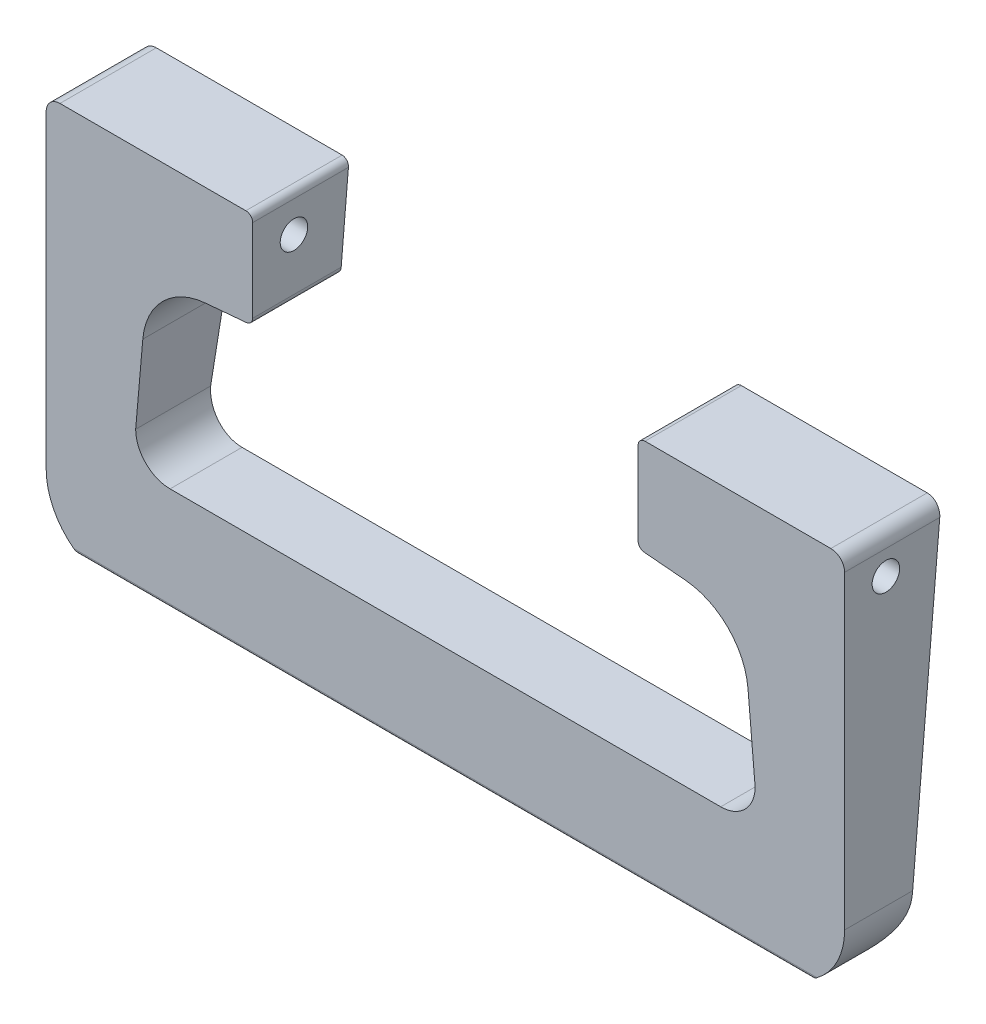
ISO-10303-21;
HEADER;
FILE_DESCRIPTION(('STEP AP214'),'2;1');
FILE_NAME('part.step','',(''),(''),'','','');
FILE_SCHEMA(('AUTOMOTIVE_DESIGN { 1 0 10303 214 1 1 1 1 }'));
ENDSEC;
DATA;
#1=APPLICATION_CONTEXT('core data for automotive mechanical design processes');
#2=APPLICATION_PROTOCOL_DEFINITION('international standard','automotive_design',2000,#1);
#3=PRODUCT_CONTEXT('',#1,'mechanical');
#4=PRODUCT('Part','Part','',(#3));
#5=PRODUCT_RELATED_PRODUCT_CATEGORY('part','',(#4));
#6=PRODUCT_DEFINITION_FORMATION('','',#4);
#7=PRODUCT_DEFINITION_CONTEXT('part definition',#1,'design');
#8=PRODUCT_DEFINITION('design','',#6,#7);
#9=PRODUCT_DEFINITION_SHAPE('','',#8);
#10=(LENGTH_UNIT() NAMED_UNIT(*) SI_UNIT(.MILLI.,.METRE.));
#11=(NAMED_UNIT(*) PLANE_ANGLE_UNIT() SI_UNIT($,.RADIAN.));
#12=(NAMED_UNIT(*) SI_UNIT($,.STERADIAN.) SOLID_ANGLE_UNIT());
#13=UNCERTAINTY_MEASURE_WITH_UNIT(LENGTH_MEASURE(1.E-05),#10,'distance_accuracy_value','');
#14=(GEOMETRIC_REPRESENTATION_CONTEXT(3) GLOBAL_UNCERTAINTY_ASSIGNED_CONTEXT((#13)) GLOBAL_UNIT_ASSIGNED_CONTEXT((#10,
#11,#12)) REPRESENTATION_CONTEXT('',''));
#15=CARTESIAN_POINT('',(0.,0.,0.));
#16=DIRECTION('',(0.,0.,1.));
#17=DIRECTION('',(1.,0.,0.));
#18=AXIS2_PLACEMENT_3D('',#15,#16,#17);
#19=CARTESIAN_POINT('',(-58.,3.5,6.));
#20=DIRECTION('',(1.,0.,0.));
#21=DIRECTION('',(0.,0.,-1.));
#22=AXIS2_PLACEMENT_3D('',#19,#20,#21);
#23=PLANE('',#22);
#24=CARTESIAN_POINT('',(-58.,0.,0.));
#25=DIRECTION('',(-1.,0.,0.));
#26=DIRECTION('',(0.,0.,1.));
#27=AXIS2_PLACEMENT_3D('',#24,#25,#26);
#28=CIRCLE('',#27,2.);
#29=CARTESIAN_POINT('',(-58.,0.,2.));
#30=VERTEX_POINT('',#29);
#31=EDGE_CURVE('E288',#30,#30,#28,.T.);
#32=ORIENTED_EDGE('',*,*,#31,.F.);
#33=EDGE_LOOP('',(#32));
#34=FACE_BOUND('',#33,.T.);
#35=DIRECTION('',(0.,0.996194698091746,-0.0871557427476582));
#36=VECTOR('',#35,1.);
#37=CARTESIAN_POINT('',(-58.,2.2996550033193,-7.72000609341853));
#38=LINE('',#37,#36);
#39=CARTESIAN_POINT('',(-58.,-41.5,-3.88803281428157));
#40=VERTEX_POINT('',#39);
#41=CARTESIAN_POINT('',(-58.,3.5,-7.82502267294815));
#42=VERTEX_POINT('',#41);
#43=EDGE_CURVE('E292',#40,#42,#38,.T.);
#44=ORIENTED_EDGE('',*,*,#43,.F.);
#45=DIRECTION('',(0.,0.,-1.));
#46=VECTOR('',#45,1.);
#47=CARTESIAN_POINT('',(-58.,-41.5,6.));
#48=LINE('',#47,#46);
#49=CARTESIAN_POINT('',(-58.,-41.5,6.));
#50=VERTEX_POINT('',#49);
#51=EDGE_CURVE('E214',#50,#40,#48,.T.);
#52=ORIENTED_EDGE('',*,*,#51,.F.);
#53=DIRECTION('',(0.,-1.,0.));
#54=VECTOR('',#53,1.);
#55=CARTESIAN_POINT('',(-58.,3.5,6.));
#56=LINE('',#55,#54);
#57=CARTESIAN_POINT('',(-58.,3.5,6.));
#58=VERTEX_POINT('',#57);
#59=EDGE_CURVE('E244',#58,#50,#56,.T.);
#60=ORIENTED_EDGE('',*,*,#59,.F.);
#61=DIRECTION('',(0.,0.,-1.));
#62=VECTOR('',#61,1.);
#63=CARTESIAN_POINT('',(-58.,3.5,6.));
#64=LINE('',#63,#62);
#65=EDGE_CURVE('E295',#58,#42,#64,.T.);
#66=ORIENTED_EDGE('',*,*,#65,.T.);
#67=EDGE_LOOP('',(#44,#52,#60,#66));
#68=FACE_BOUND('',#67,.T.);
#69=ADVANCED_FACE('F14',(#34,#68),#23,.F.);
#70=CARTESIAN_POINT('',(-48.,-41.5,6.));
#71=DIRECTION('',(0.,0.,-1.));
#72=DIRECTION('',(-1.,0.,0.));
#73=AXIS2_PLACEMENT_3D('',#70,#71,#72);
#74=CYLINDRICAL_SURFACE('',#73,10.);
#75=CARTESIAN_POINT('',(-48.,-41.5,-3.88803281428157));
#76=DIRECTION('',(0.,-0.0871557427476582,-0.996194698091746));
#77=DIRECTION('',(0.,0.996194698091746,-0.0871557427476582));
#78=AXIS2_PLACEMENT_3D('',#75,#76,#77);
#79=ELLIPSE('',#78,10.0381983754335,10.);
#80=CARTESIAN_POINT('',(-57.9280714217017,-42.6972459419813,-3.7832873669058));
#81=VERTEX_POINT('',#80);
#82=EDGE_CURVE('E297',#81,#40,#79,.T.);
#83=ORIENTED_EDGE('',*,*,#82,.F.);
#84=CARTESIAN_POINT('',(-57.9280714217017,-42.6972459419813,-3.7832873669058));
#85=CARTESIAN_POINT('',(-57.9157537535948,-42.7994032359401,-3.7743510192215));
#86=CARTESIAN_POINT('',(-57.9018780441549,-42.9011836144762,-3.76346541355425));
#87=CARTESIAN_POINT('',(-57.8710868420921,-43.1037888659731,-3.73787475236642));
#88=CARTESIAN_POINT('',(-57.8541716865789,-43.2046138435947,-3.72317012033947));
#89=CARTESIAN_POINT('',(-57.7990262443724,-43.5051179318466,-3.67348712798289));
#90=CARTESIAN_POINT('',(-57.7563625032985,-43.7031014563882,-3.63291525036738));
#91=CARTESIAN_POINT('',(-57.6605248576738,-44.0911125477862,-3.53815852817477));
#92=CARTESIAN_POINT('',(-57.6074492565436,-44.2811957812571,-3.48409981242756));
#93=CARTESIAN_POINT('',(-57.4915317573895,-44.6542000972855,-3.36314514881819));
#94=CARTESIAN_POINT('',(-57.4286874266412,-44.8371193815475,-3.29624600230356));
#95=CARTESIAN_POINT('',(-57.2946218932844,-45.1940746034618,-3.15095377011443));
#96=CARTESIAN_POINT('',(-57.2234391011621,-45.3681463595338,-3.07261300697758));
#97=CARTESIAN_POINT('',(-57.0736065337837,-45.7076273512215,-2.90522726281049));
#98=CARTESIAN_POINT('',(-56.9949572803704,-45.8730371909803,-2.81618302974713));
#99=CARTESIAN_POINT('',(-56.7489469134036,-46.3566197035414,-2.53380329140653));
#100=CARTESIAN_POINT('',(-56.5718301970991,-46.6613491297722,-2.32555116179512));
#101=CARTESIAN_POINT('',(-56.2554110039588,-47.1485483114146,-1.94221277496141));
#102=CARTESIAN_POINT('',(-56.1203513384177,-47.3405790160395,-1.77544478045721));
#103=CARTESIAN_POINT('',(-55.8445680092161,-47.7060533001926,-1.42663851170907));
#104=CARTESIAN_POINT('',(-55.7038419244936,-47.8794888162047,-1.24459367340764));
#105=CARTESIAN_POINT('',(-55.4197519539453,-48.2077915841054,-0.866074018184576));
#106=CARTESIAN_POINT('',(-55.2763858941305,-48.3626426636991,-0.669586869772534));
#107=CARTESIAN_POINT('',(-54.9905769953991,-48.6535540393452,-0.262636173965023));
#108=CARTESIAN_POINT('',(-54.8481338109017,-48.7896218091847,-0.0521782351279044));
#109=CARTESIAN_POINT('',(-54.6111434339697,-49.0039967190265,0.316572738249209));
#110=CARTESIAN_POINT('',(-54.5152619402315,-49.0872481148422,0.471152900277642));
#111=CARTESIAN_POINT('',(-54.3277600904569,-49.2443136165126,0.787574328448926));
#112=CARTESIAN_POINT('',(-54.2361399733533,-49.3181271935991,0.949416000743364));
#113=CARTESIAN_POINT('',(-54.0595822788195,-49.4557504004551,1.2804425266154));
#114=CARTESIAN_POINT('',(-53.9746325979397,-49.519578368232,1.44961317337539));
#115=CARTESIAN_POINT('',(-53.8141416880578,-49.6366836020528,1.7957718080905));
#116=CARTESIAN_POINT('',(-53.7385959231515,-49.6899659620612,1.97275597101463));
#117=CARTESIAN_POINT('',(-53.574908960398,-49.802625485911,2.40175247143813));
#118=CARTESIAN_POINT('',(-53.4923755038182,-49.8570204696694,2.65739166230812));
#119=CARTESIAN_POINT('',(-53.39494645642,-49.9199791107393,3.0498412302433));
#120=CARTESIAN_POINT('',(-53.3668846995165,-49.9378485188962,3.18197885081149));
#121=CARTESIAN_POINT('',(-53.3206969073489,-49.9670501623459,3.44866664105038));
#122=CARTESIAN_POINT('',(-53.3025641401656,-49.9783868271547,3.58321511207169));
#123=CARTESIAN_POINT('',(-53.2825570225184,-49.990857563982,3.79607440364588));
#124=CARTESIAN_POINT('',(-53.2770473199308,-49.9942805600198,3.87393028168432));
#125=CARTESIAN_POINT('',(-53.269676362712,-49.9988539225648,4.02994242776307));
#126=CARTESIAN_POINT('',(-53.2678180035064,-50.000002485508,4.10809888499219));
#127=CARTESIAN_POINT('',(-53.2678268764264,-50.,4.18627021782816));
#128=B_SPLINE_CURVE_WITH_KNOTS('',3,(#84,#85,#86,#87,#88,#89,#90,#91,#92,#93,#94,#95,#96,#97,
#98,#99,#100,#101,#102,#103,#104,#105,#106,#107,#108,#109,#110,#111,#112,#113,#114,#115,#116,
#117,#118,#119,#120,#121,#122,#123,#124,#125,#126,#127),.UNSPECIFIED.,.F.,.F.,(4,2,2,2,2,2,2,2,
2,2,2,2,2,2,2,2,2,2,2,2,2,4),(0.,0.309788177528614,0.619542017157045,1.23821807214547,
1.85131199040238,2.46455883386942,3.07508435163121,3.68556723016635,4.90925171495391,
5.77223517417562,6.63559135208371,7.49969346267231,8.36345075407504,8.96324930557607,
9.56308144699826,10.1617987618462,10.7602261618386,11.5790438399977,11.9873936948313,
12.3954663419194,12.6297359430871,12.8641912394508),.UNSPECIFIED.);
#129=CARTESIAN_POINT('',(-53.2678268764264,-50.,4.18627021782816));
#130=VERTEX_POINT('',#129);
#131=EDGE_CURVE('E200',#81,#130,#128,.T.);
#132=ORIENTED_EDGE('',*,*,#131,.T.);
#133=DIRECTION('',(0.,0.,-1.));
#134=VECTOR('',#133,1.);
#135=CARTESIAN_POINT('',(-53.2678268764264,-50.,6.));
#136=LINE('',#135,#134);
#137=CARTESIAN_POINT('',(-53.2678268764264,-50.,5.5));
#138=VERTEX_POINT('',#137);
#139=EDGE_CURVE('E242',#138,#130,#136,.T.);
#140=ORIENTED_EDGE('',*,*,#139,.F.);
#141=CARTESIAN_POINT('',(-53.2678268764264,-50.,5.5));
#142=CARTESIAN_POINT('',(-53.2677926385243,-50.0000200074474,5.51595689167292));
#143=CARTESIAN_POINT('',(-53.2690577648,-49.9992372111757,5.53186312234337));
#144=CARTESIAN_POINT('',(-53.273872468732,-49.9962510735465,5.5630221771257));
#145=CARTESIAN_POINT('',(-53.2773976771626,-49.9940628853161,5.57828014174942));
#146=CARTESIAN_POINT('',(-53.2874978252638,-49.9877798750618,5.61145249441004));
#147=CARTESIAN_POINT('',(-53.2945967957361,-49.9833565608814,5.62914190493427));
#148=CARTESIAN_POINT('',(-53.311117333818,-49.9730235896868,5.66298309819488));
#149=CARTESIAN_POINT('',(-53.3205490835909,-49.9671074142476,5.67912769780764));
#150=CARTESIAN_POINT('',(-53.3466160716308,-49.9506828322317,5.71803998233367));
#151=CARTESIAN_POINT('',(-53.3643996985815,-49.939414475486,5.73970844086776));
#152=CARTESIAN_POINT('',(-53.4023883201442,-49.9151479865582,5.77964018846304));
#153=CARTESIAN_POINT('',(-53.4225981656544,-49.9021463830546,5.79789646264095));
#154=CARTESIAN_POINT('',(-53.4801684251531,-49.8647857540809,5.84403841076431));
#155=CARTESIAN_POINT('',(-53.5190846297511,-49.8391843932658,5.86895931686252));
#156=CARTESIAN_POINT('',(-53.5991618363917,-49.7856342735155,5.91181056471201));
#157=CARTESIAN_POINT('',(-53.6403309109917,-49.7576768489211,5.92971359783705));
#158=CARTESIAN_POINT('',(-53.7083053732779,-49.7107414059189,5.95387544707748));
#159=CARTESIAN_POINT('',(-53.734808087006,-49.6922546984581,5.96199355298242));
#160=CARTESIAN_POINT('',(-53.7880493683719,-49.6547253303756,5.97587896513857));
#161=CARTESIAN_POINT('',(-53.8147880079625,-49.6356824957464,5.9816455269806));
#162=CARTESIAN_POINT('',(-53.8679956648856,-49.5973876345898,5.99081442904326));
#163=CARTESIAN_POINT('',(-53.8944638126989,-49.5781413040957,5.99424576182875));
#164=CARTESIAN_POINT('',(-53.9473200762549,-49.5393074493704,5.99883318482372));
#165=CARTESIAN_POINT('',(-53.9737082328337,-49.5197201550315,5.99999075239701));
#166=CARTESIAN_POINT('',(-54.,-49.5,6.));
#167=B_SPLINE_CURVE_WITH_KNOTS('',3,(#141,#142,#143,#144,#145,#146,#147,#148,#149,#150,#151,
#152,#153,#154,#155,#156,#157,#158,#159,#160,#161,#162,#163,#164,#165,#166),.UNSPECIFIED.,.F.,
.F.,(4,2,2,2,2,2,2,2,2,2,2,2,4),(0.,0.0477194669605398,0.0949328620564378,0.153310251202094,
0.211947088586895,0.302073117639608,0.392382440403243,0.550002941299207,0.708230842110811,
0.808099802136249,0.908000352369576,1.00663680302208,1.10520914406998),.UNSPECIFIED.);
#168=CARTESIAN_POINT('',(-54.,-49.5,6.));
#169=VERTEX_POINT('',#168);
#170=EDGE_CURVE('E251',#138,#169,#167,.T.);
#171=ORIENTED_EDGE('',*,*,#170,.T.);
#172=CARTESIAN_POINT('',(-48.,-41.5,6.));
#173=DIRECTION('',(0.,0.,1.));
#174=DIRECTION('',(1.,0.,0.));
#175=AXIS2_PLACEMENT_3D('',#172,#173,#174);
#176=CIRCLE('',#175,10.);
#177=EDGE_CURVE('E300',#50,#169,#176,.T.);
#178=ORIENTED_EDGE('',*,*,#177,.F.);
#179=ORIENTED_EDGE('',*,*,#51,.T.);
#180=EDGE_LOOP('',(#83,#132,#140,#171,#178,#179));
#181=FACE_BOUND('',#180,.T.);
#182=ADVANCED_FACE('F246',(#181),#74,.T.);
#183=CARTESIAN_POINT('',(48.,-41.5,6.));
#184=DIRECTION('',(0.,0.,-1.));
#185=DIRECTION('',(-1.,0.,0.));
#186=AXIS2_PLACEMENT_3D('',#183,#184,#185);
#187=CYLINDRICAL_SURFACE('',#186,10.);
#188=CARTESIAN_POINT('',(48.,-41.5,-3.88803281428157));
#189=DIRECTION('',(0.,-0.0871557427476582,-0.996194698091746));
#190=DIRECTION('',(0.,0.996194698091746,-0.0871557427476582));
#191=AXIS2_PLACEMENT_3D('',#188,#189,#190);
#192=ELLIPSE('',#191,10.0381983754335,10.);
#193=CARTESIAN_POINT('',(58.,-41.5,-3.88803281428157));
#194=VERTEX_POINT('',#193);
#195=CARTESIAN_POINT('',(57.9280714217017,-42.6972459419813,-3.7832873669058));
#196=VERTEX_POINT('',#195);
#197=EDGE_CURVE('E183',#194,#196,#192,.T.);
#198=ORIENTED_EDGE('',*,*,#197,.F.);
#199=DIRECTION('',(0.,0.,-1.));
#200=VECTOR('',#199,1.);
#201=CARTESIAN_POINT('',(58.,-41.5,6.));
#202=LINE('',#201,#200);
#203=CARTESIAN_POINT('',(58.,-41.5,6.));
#204=VERTEX_POINT('',#203);
#205=EDGE_CURVE('E301',#204,#194,#202,.T.);
#206=ORIENTED_EDGE('',*,*,#205,.F.);
#207=CARTESIAN_POINT('',(48.,-41.5,6.));
#208=DIRECTION('',(0.,0.,1.));
#209=DIRECTION('',(1.,0.,0.));
#210=AXIS2_PLACEMENT_3D('',#207,#208,#209);
#211=CIRCLE('',#210,10.);
#212=CARTESIAN_POINT('',(54.,-49.5,6.));
#213=VERTEX_POINT('',#212);
#214=EDGE_CURVE('E410',#213,#204,#211,.T.);
#215=ORIENTED_EDGE('',*,*,#214,.F.);
#216=CARTESIAN_POINT('',(54.,-49.5,6.));
#217=CARTESIAN_POINT('',(53.9685522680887,-49.5235886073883,5.9999806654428));
#218=CARTESIAN_POINT('',(53.9369642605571,-49.5469871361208,5.99833014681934));
#219=CARTESIAN_POINT('',(53.8736758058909,-49.5932972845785,5.99178111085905));
#220=CARTESIAN_POINT('',(53.8419752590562,-49.6162079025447,5.9868764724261));
#221=CARTESIAN_POINT('',(53.7784789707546,-49.6615389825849,5.97377783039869));
#222=CARTESIAN_POINT('',(53.746684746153,-49.6839535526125,5.96555596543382));
#223=CARTESIAN_POINT('',(53.6835912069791,-49.7278955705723,5.9456960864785));
#224=CARTESIAN_POINT('',(53.6522914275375,-49.749423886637,5.93406151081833));
#225=CARTESIAN_POINT('',(53.5910784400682,-49.7910305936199,5.90731184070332));
#226=CARTESIAN_POINT('',(53.5611507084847,-49.8111274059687,5.89225924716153));
#227=CARTESIAN_POINT('',(53.5027449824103,-49.8499113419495,5.85809251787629));
#228=CARTESIAN_POINT('',(53.4742648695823,-49.8686005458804,5.83898454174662));
#229=CARTESIAN_POINT('',(53.4260495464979,-49.8999175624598,5.80087569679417));
#230=CARTESIAN_POINT('',(53.4058080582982,-49.9129517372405,5.78285791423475));
#231=CARTESIAN_POINT('',(53.3676684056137,-49.9373362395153,5.74345982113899));
#232=CARTESIAN_POINT('',(53.3497660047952,-49.9486896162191,5.72208574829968));
#233=CARTESIAN_POINT('',(53.3238305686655,-49.9650439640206,5.68434238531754));
#234=CARTESIAN_POINT('',(53.3146221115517,-49.9708256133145,5.66912685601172));
#235=CARTESIAN_POINT('',(53.2982484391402,-49.9810763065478,5.63727604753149));
#236=CARTESIAN_POINT('',(53.2910750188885,-49.9855506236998,5.62064683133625));
#237=CARTESIAN_POINT('',(53.2796927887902,-49.9926373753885,5.58707803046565));
#238=CARTESIAN_POINT('',(53.2753403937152,-49.9953400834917,5.57020803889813));
#239=CARTESIAN_POINT('',(53.2693638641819,-49.9990475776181,5.53559104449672));
#240=CARTESIAN_POINT('',(53.2677764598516,-50.000029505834,5.51783541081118));
#241=CARTESIAN_POINT('',(53.2678268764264,-50.,5.5));
#242=B_SPLINE_CURVE_WITH_KNOTS('',3,(#216,#217,#218,#219,#220,#221,#222,#223,#224,#225,#226,
#227,#228,#229,#230,#231,#232,#233,#234,#235,#236,#237,#238,#239,#240,#241),.UNSPECIFIED.,.F.,
.F.,(4,2,2,2,2,2,2,2,2,2,2,2,4),(0.,0.117897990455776,0.236018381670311,0.355152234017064,
0.474166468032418,0.591158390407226,0.707973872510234,0.797963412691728,0.887787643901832,
0.943726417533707,0.999436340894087,1.05202488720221,1.10530683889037),.UNSPECIFIED.);
#243=CARTESIAN_POINT('',(53.2678268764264,-50.,5.5));
#244=VERTEX_POINT('',#243);
#245=EDGE_CURVE('E193',#213,#244,#242,.T.);
#246=ORIENTED_EDGE('',*,*,#245,.T.);
#247=DIRECTION('',(0.,0.,-1.));
#248=VECTOR('',#247,1.);
#249=CARTESIAN_POINT('',(53.2678268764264,-50.,6.));
#250=LINE('',#249,#248);
#251=CARTESIAN_POINT('',(53.2678268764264,-50.,4.18627021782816));
#252=VERTEX_POINT('',#251);
#253=EDGE_CURVE('E23',#252,#244,#250,.F.);
#254=ORIENTED_EDGE('',*,*,#253,.F.);
#255=CARTESIAN_POINT('',(53.2678268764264,-50.,4.18627021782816));
#256=CARTESIAN_POINT('',(53.2677251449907,-50.0000327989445,4.0488509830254));
#257=CARTESIAN_POINT('',(53.2735375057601,-49.9964607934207,3.91149637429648));
#258=CARTESIAN_POINT('',(53.2961927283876,-49.9823731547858,3.63832521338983));
#259=CARTESIAN_POINT('',(53.3130135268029,-49.9718714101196,3.50250613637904));
#260=CARTESIAN_POINT('',(53.3565585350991,-49.9443998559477,3.23531359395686));
#261=CARTESIAN_POINT('',(53.3831275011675,-49.9275313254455,3.10390391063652));
#262=CARTESIAN_POINT('',(53.444990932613,-49.8876954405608,2.84405360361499));
#263=CARTESIAN_POINT('',(53.4802903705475,-49.864724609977,2.71561471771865));
#264=CARTESIAN_POINT('',(53.5742381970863,-49.8025413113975,2.41045568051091));
#265=CARTESIAN_POINT('',(53.6365357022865,-49.7605266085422,2.23542933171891));
#266=CARTESIAN_POINT('',(53.7723124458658,-49.666225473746,1.89266529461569));
#267=CARTESIAN_POINT('',(53.8457963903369,-49.6139347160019,1.72493071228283));
#268=CARTESIAN_POINT('',(54.0015481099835,-49.4994270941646,1.39534385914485));
#269=CARTESIAN_POINT('',(54.0838814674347,-49.4371341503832,1.23354939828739));
#270=CARTESIAN_POINT('',(54.2543937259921,-49.303480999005,0.91691220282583));
#271=CARTESIAN_POINT('',(54.3425746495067,-49.2321176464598,0.762071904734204));
#272=CARTESIAN_POINT('',(54.5699140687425,-49.0411065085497,0.379773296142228));
#273=CARTESIAN_POINT('',(54.7116193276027,-48.9157223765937,0.156677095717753));
#274=CARTESIAN_POINT('',(54.9986702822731,-48.6454574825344,-0.274978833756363));
#275=CARTESIAN_POINT('',(55.1440177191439,-48.5005672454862,-0.483531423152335));
#276=CARTESIAN_POINT('',(55.4340579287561,-48.1917558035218,-0.885844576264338));
#277=CARTESIAN_POINT('',(55.5787513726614,-48.0278649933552,-1.079627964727));
#278=CARTESIAN_POINT('',(55.8642852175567,-47.6808965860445,-1.45218404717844));
#279=CARTESIAN_POINT('',(56.0051270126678,-47.49782605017,-1.6309622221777));
#280=CARTESIAN_POINT('',(56.2533375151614,-47.1496806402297,-1.93940654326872));
#281=CARTESIAN_POINT('',(56.3619175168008,-46.987958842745,-2.07188933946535));
#282=CARTESIAN_POINT('',(56.5729491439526,-46.6520736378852,-2.32544781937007));
#283=CARTESIAN_POINT('',(56.6754021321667,-46.477913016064,-2.4465260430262));
#284=CARTESIAN_POINT('',(56.872229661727,-46.1179516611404,-2.67578850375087));
#285=CARTESIAN_POINT('',(56.966630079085,-45.932191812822,-2.78401451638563));
#286=CARTESIAN_POINT('',(57.1460704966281,-45.5489683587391,-2.98672056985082));
#287=CARTESIAN_POINT('',(57.2311107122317,-45.3515050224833,-3.08120092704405));
#288=CARTESIAN_POINT('',(57.3841553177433,-44.9609596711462,-3.2484035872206));
#289=CARTESIAN_POINT('',(57.4529598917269,-44.7686648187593,-3.32222779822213));
#290=CARTESIAN_POINT('',(57.5797855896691,-44.3758123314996,-3.45562301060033));
#291=CARTESIAN_POINT('',(57.637810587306,-44.175257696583,-3.51519913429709));
#292=CARTESIAN_POINT('',(57.7424491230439,-43.7649384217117,-3.6195122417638));
#293=CARTESIAN_POINT('',(57.7889349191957,-43.5550985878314,-3.66408490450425));
#294=CARTESIAN_POINT('',(57.8487151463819,-43.2362464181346,-3.71837161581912));
#295=CARTESIAN_POINT('',(57.8669948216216,-43.1291898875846,-3.73437984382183));
#296=CARTESIAN_POINT('',(57.9001272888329,-42.9139800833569,-3.76208903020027));
#297=CARTESIAN_POINT('',(57.9149796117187,-42.8058266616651,-3.77378939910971));
#298=CARTESIAN_POINT('',(57.9280714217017,-42.6972459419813,-3.7832873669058));
#299=B_SPLINE_CURVE_WITH_KNOTS('',3,(#255,#256,#257,#258,#259,#260,#261,#262,#263,#264,#265,
#266,#267,#268,#269,#270,#271,#272,#273,#274,#275,#276,#277,#278,#279,#280,#281,#282,#283,#284,
#285,#286,#287,#288,#289,#290,#291,#292,#293,#294,#295,#296,#297,#298),.UNSPECIFIED.,.F.,.F.,(4,
2,2,2,2,2,2,2,2,2,2,2,2,2,2,2,2,2,2,2,2,4),(0.,0.41198520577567,0.82314721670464,
1.22802697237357,1.63313786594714,2.20362074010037,2.77434428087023,3.34963470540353,
3.92512514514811,4.80151989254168,5.67834188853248,6.5537801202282,7.42889717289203,
8.13499963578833,8.84094446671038,9.54452791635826,10.2480951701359,10.8987548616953,
11.5491802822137,12.2065136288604,12.5357263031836,12.8649840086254),.UNSPECIFIED.);
#300=EDGE_CURVE('E9',#252,#196,#299,.T.);
#301=ORIENTED_EDGE('',*,*,#300,.T.);
#302=EDGE_LOOP('',(#198,#206,#215,#246,#254,#301));
#303=FACE_BOUND('',#302,.T.);
#304=ADVANCED_FACE('F205',(#303),#187,.T.);
#305=CARTESIAN_POINT('',(58.,-41.5,6.));
#306=DIRECTION('',(-1.,0.,0.));
#307=DIRECTION('',(0.,0.,1.));
#308=AXIS2_PLACEMENT_3D('',#305,#306,#307);
#309=PLANE('',#308);
#310=CARTESIAN_POINT('',(58.,0.,0.));
#311=DIRECTION('',(-1.,0.,0.));
#312=DIRECTION('',(0.,0.,1.));
#313=AXIS2_PLACEMENT_3D('',#310,#311,#312);
#314=CIRCLE('',#313,2.);
#315=CARTESIAN_POINT('',(58.,0.,2.));
#316=VERTEX_POINT('',#315);
#317=EDGE_CURVE('E500',#316,#316,#314,.T.);
#318=ORIENTED_EDGE('',*,*,#317,.T.);
#319=EDGE_LOOP('',(#318));
#320=FACE_BOUND('',#319,.T.);
#321=DIRECTION('',(0.,-0.996194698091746,0.0871557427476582));
#322=VECTOR('',#321,1.);
#323=CARTESIAN_POINT('',(58.,-42.3585194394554,-3.8129220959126));
#324=LINE('',#323,#322);
#325=CARTESIAN_POINT('',(58.,3.5,-7.82502267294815));
#326=VERTEX_POINT('',#325);
#327=EDGE_CURVE('E189',#326,#194,#324,.T.);
#328=ORIENTED_EDGE('',*,*,#327,.F.);
#329=DIRECTION('',(0.,0.,-1.));
#330=VECTOR('',#329,1.);
#331=CARTESIAN_POINT('',(58.,3.5,6.));
#332=LINE('',#331,#330);
#333=CARTESIAN_POINT('',(58.,3.5,6.));
#334=VERTEX_POINT('',#333);
#335=EDGE_CURVE('E302',#334,#326,#332,.T.);
#336=ORIENTED_EDGE('',*,*,#335,.F.);
#337=DIRECTION('',(0.,1.,0.));
#338=VECTOR('',#337,1.);
#339=CARTESIAN_POINT('',(58.,-41.5,6.));
#340=LINE('',#339,#338);
#341=EDGE_CURVE('E408',#204,#334,#340,.T.);
#342=ORIENTED_EDGE('',*,*,#341,.F.);
#343=ORIENTED_EDGE('',*,*,#205,.T.);
#344=EDGE_LOOP('',(#328,#336,#342,#343));
#345=FACE_BOUND('',#344,.T.);
#346=ADVANCED_FACE('F490',(#320,#345),#309,.F.);
#347=CARTESIAN_POINT('',(56.,3.5,6.));
#348=DIRECTION('',(0.,0.,-1.));
#349=DIRECTION('',(-1.,0.,0.));
#350=AXIS2_PLACEMENT_3D('',#347,#348,#349);
#351=CYLINDRICAL_SURFACE('',#350,2.);
#352=CARTESIAN_POINT('',(56.,3.5,-7.82502267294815));
#353=DIRECTION('',(0.,-0.0871557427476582,-0.996194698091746));
#354=DIRECTION('',(0.,0.996194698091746,-0.0871557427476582));
#355=AXIS2_PLACEMENT_3D('',#352,#353,#354);
#356=ELLIPSE('',#355,2.0076396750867,2.);
#357=CARTESIAN_POINT('',(56.,5.5,-8.));
#358=VERTEX_POINT('',#357);
#359=EDGE_CURVE('E504',#358,#326,#356,.T.);
#360=ORIENTED_EDGE('',*,*,#359,.F.);
#361=DIRECTION('',(0.,0.,-1.));
#362=VECTOR('',#361,1.);
#363=CARTESIAN_POINT('',(56.,5.5,6.));
#364=LINE('',#363,#362);
#365=CARTESIAN_POINT('',(56.,5.5,6.));
#366=VERTEX_POINT('',#365);
#367=EDGE_CURVE('E307',#366,#358,#364,.T.);
#368=ORIENTED_EDGE('',*,*,#367,.F.);
#369=CARTESIAN_POINT('',(56.,3.5,6.));
#370=DIRECTION('',(0.,0.,1.));
#371=DIRECTION('',(1.,0.,0.));
#372=AXIS2_PLACEMENT_3D('',#369,#370,#371);
#373=CIRCLE('',#372,2.);
#374=EDGE_CURVE('E406',#334,#366,#373,.T.);
#375=ORIENTED_EDGE('',*,*,#374,.F.);
#376=ORIENTED_EDGE('',*,*,#335,.T.);
#377=EDGE_LOOP('',(#360,#368,#375,#376));
#378=FACE_BOUND('',#377,.T.);
#379=ADVANCED_FACE('F486',(#378),#351,.T.);
#380=CARTESIAN_POINT('',(29.,4.5,6.));
#381=DIRECTION('',(0.,0.,-1.));
#382=DIRECTION('',(-1.,0.,0.));
#383=AXIS2_PLACEMENT_3D('',#380,#381,#382);
#384=CYLINDRICAL_SURFACE('',#383,1.);
#385=CARTESIAN_POINT('',(29.,4.5,-7.91251133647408));
#386=DIRECTION('',(0.,-0.0871557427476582,-0.996194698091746));
#387=DIRECTION('',(0.,0.996194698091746,-0.0871557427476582));
#388=AXIS2_PLACEMENT_3D('',#385,#386,#387);
#389=ELLIPSE('',#388,1.00381983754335,1.);
#390=CARTESIAN_POINT('',(28.,4.5,-7.91251133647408));
#391=VERTEX_POINT('',#390);
#392=CARTESIAN_POINT('',(29.,5.5,-8.));
#393=VERTEX_POINT('',#392);
#394=EDGE_CURVE('E551',#391,#393,#389,.T.);
#395=ORIENTED_EDGE('',*,*,#394,.F.);
#396=DIRECTION('',(0.,0.,-1.));
#397=VECTOR('',#396,1.);
#398=CARTESIAN_POINT('',(28.,4.5,6.));
#399=LINE('',#398,#397);
#400=CARTESIAN_POINT('',(28.,4.5,6.));
#401=VERTEX_POINT('',#400);
#402=EDGE_CURVE('E313',#401,#391,#399,.T.);
#403=ORIENTED_EDGE('',*,*,#402,.F.);
#404=CARTESIAN_POINT('',(29.,4.5,6.));
#405=DIRECTION('',(0.,0.,1.));
#406=DIRECTION('',(1.,0.,0.));
#407=AXIS2_PLACEMENT_3D('',#404,#405,#406);
#408=CIRCLE('',#407,1.);
#409=CARTESIAN_POINT('',(29.,5.5,6.));
#410=VERTEX_POINT('',#409);
#411=EDGE_CURVE('E402',#410,#401,#408,.T.);
#412=ORIENTED_EDGE('',*,*,#411,.F.);
#413=DIRECTION('',(0.,0.,-1.));
#414=VECTOR('',#413,1.);
#415=CARTESIAN_POINT('',(29.,5.5,6.));
#416=LINE('',#415,#414);
#417=EDGE_CURVE('E310',#410,#393,#416,.T.);
#418=ORIENTED_EDGE('',*,*,#417,.T.);
#419=EDGE_LOOP('',(#395,#403,#412,#418));
#420=FACE_BOUND('',#419,.T.);
#421=ADVANCED_FACE('F483',(#420),#384,.T.);
#422=CARTESIAN_POINT('',(28.,4.5,6.));
#423=DIRECTION('',(1.,0.,0.));
#424=DIRECTION('',(0.,0.,-1.));
#425=AXIS2_PLACEMENT_3D('',#422,#423,#424);
#426=PLANE('',#425);
#427=CARTESIAN_POINT('',(28.,0.,0.));
#428=DIRECTION('',(1.,0.,0.));
#429=DIRECTION('',(0.,0.,-1.));
#430=AXIS2_PLACEMENT_3D('',#427,#428,#429);
#431=CIRCLE('',#430,2.);
#432=CARTESIAN_POINT('',(28.,0.,-2.));
#433=VERTEX_POINT('',#432);
#434=EDGE_CURVE('E513',#433,#433,#431,.T.);
#435=ORIENTED_EDGE('',*,*,#434,.T.);
#436=EDGE_LOOP('',(#435));
#437=FACE_BOUND('',#436,.T.);
#438=DIRECTION('',(0.,0.996194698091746,-0.0871557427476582));
#439=VECTOR('',#438,1.);
#440=CARTESIAN_POINT('',(28.,3.2920588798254,-7.80683018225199));
#441=LINE('',#440,#439);
#442=CARTESIAN_POINT('',(28.,-7.53335140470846,-6.85972950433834));
#443=VERTEX_POINT('',#442);
#444=EDGE_CURVE('E549',#443,#391,#441,.T.);
#445=ORIENTED_EDGE('',*,*,#444,.F.);
#446=DIRECTION('',(0.,0.,-1.));
#447=VECTOR('',#446,1.);
#448=CARTESIAN_POINT('',(28.,-7.53335140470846,6.));
#449=LINE('',#448,#447);
#450=CARTESIAN_POINT('',(28.,-7.53335140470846,6.));
#451=VERTEX_POINT('',#450);
#452=EDGE_CURVE('E316',#451,#443,#449,.T.);
#453=ORIENTED_EDGE('',*,*,#452,.F.);
#454=DIRECTION('',(0.,-1.,0.));
#455=VECTOR('',#454,1.);
#456=CARTESIAN_POINT('',(28.,4.5,6.));
#457=LINE('',#456,#455);
#458=EDGE_CURVE('E400',#401,#451,#457,.T.);
#459=ORIENTED_EDGE('',*,*,#458,.F.);
#460=ORIENTED_EDGE('',*,*,#402,.T.);
#461=EDGE_LOOP('',(#445,#453,#459,#460));
#462=FACE_BOUND('',#461,.T.);
#463=ADVANCED_FACE('F479',(#437,#462),#426,.F.);
#464=CARTESIAN_POINT('',(29.,-7.53335140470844,6.));
#465=DIRECTION('',(0.,0.,-1.));
#466=DIRECTION('',(-1.,0.,0.));
#467=AXIS2_PLACEMENT_3D('',#464,#465,#466);
#468=CYLINDRICAL_SURFACE('',#467,1.);
#469=CARTESIAN_POINT('',(29.,-7.53335140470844,-6.85972950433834));
#470=DIRECTION('',(0.,-0.0871557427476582,-0.996194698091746));
#471=DIRECTION('',(0.,0.996194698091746,-0.0871557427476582));
#472=AXIS2_PLACEMENT_3D('',#469,#470,#471);
#473=ELLIPSE('',#472,1.00381983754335,1.);
#474=CARTESIAN_POINT('',(28.9128442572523,-8.5295461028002,-6.77257376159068));
#475=VERTEX_POINT('',#474);
#476=EDGE_CURVE('E547',#475,#443,#473,.T.);
#477=ORIENTED_EDGE('',*,*,#476,.F.);
#478=DIRECTION('',(0.,0.,-1.));
#479=VECTOR('',#478,1.);
#480=CARTESIAN_POINT('',(28.9128442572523,-8.5295461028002,6.));
#481=LINE('',#480,#479);
#482=CARTESIAN_POINT('',(28.9128442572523,-8.5295461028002,6.));
#483=VERTEX_POINT('',#482);
#484=EDGE_CURVE('E319',#483,#475,#481,.T.);
#485=ORIENTED_EDGE('',*,*,#484,.F.);
#486=CARTESIAN_POINT('',(29.,-7.53335140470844,6.));
#487=DIRECTION('',(0.,0.,1.));
#488=DIRECTION('',(1.,0.,0.));
#489=AXIS2_PLACEMENT_3D('',#486,#487,#488);
#490=CIRCLE('',#489,1.);
#491=EDGE_CURVE('E398',#451,#483,#490,.T.);
#492=ORIENTED_EDGE('',*,*,#491,.F.);
#493=ORIENTED_EDGE('',*,*,#452,.T.);
#494=EDGE_LOOP('',(#477,#485,#492,#493));
#495=FACE_BOUND('',#494,.T.);
#496=ADVANCED_FACE('F475',(#495),#468,.T.);
#497=CARTESIAN_POINT('',(28.9128442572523,-8.5295461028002,6.));
#498=DIRECTION('',(0.0871557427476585,0.996194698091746,0.));
#499=DIRECTION('',(-0.996194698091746,0.0871557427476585,0.));
#500=AXIS2_PLACEMENT_3D('',#497,#498,#499);
#501=PLANE('',#500);
#502=DIRECTION('',(-0.996165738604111,0.087153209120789,-0.0076249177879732));
#503=VECTOR('',#502,1.);
#504=CARTESIAN_POINT('',(29.0098606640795,-8.53803393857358,-6.77183117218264));
#505=LINE('',#504,#503);
#506=CARTESIAN_POINT('',(34.8721089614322,-9.0509142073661,-6.72695996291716));
#507=VERTEX_POINT('',#506);
#508=EDGE_CURVE('E545',#507,#475,#505,.T.);
#509=ORIENTED_EDGE('',*,*,#508,.F.);
#510=DIRECTION('',(0.,0.,-1.));
#511=VECTOR('',#510,1.);
#512=CARTESIAN_POINT('',(34.8721089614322,-9.0509142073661,6.));
#513=LINE('',#512,#511);
#514=CARTESIAN_POINT('',(34.8721089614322,-9.0509142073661,6.));
#515=VERTEX_POINT('',#514);
#516=EDGE_CURVE('E322',#515,#507,#513,.T.);
#517=ORIENTED_EDGE('',*,*,#516,.F.);
#518=DIRECTION('',(0.996194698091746,-0.0871557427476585,0.));
#519=VECTOR('',#518,1.);
#520=CARTESIAN_POINT('',(28.9128442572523,-8.5295461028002,6.));
#521=LINE('',#520,#519);
#522=EDGE_CURVE('E396',#483,#515,#521,.T.);
#523=ORIENTED_EDGE('',*,*,#522,.F.);
#524=ORIENTED_EDGE('',*,*,#484,.T.);
#525=EDGE_LOOP('',(#509,#517,#523,#524));
#526=FACE_BOUND('',#525,.T.);
#527=ADVANCED_FACE('F471',(#526),#501,.F.);
#528=CARTESIAN_POINT('',(34.0005515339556,-19.0128611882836,6.));
#529=DIRECTION('',(0.,0.,-1.));
#530=DIRECTION('',(-1.,0.,0.));
#531=AXIS2_PLACEMENT_3D('',#528,#529,#530);
#532=CYLINDRICAL_SURFACE('',#531,10.);
#533=ORIENTED_EDGE('',*,*,#516,.T.);
#534=CARTESIAN_POINT('',(34.0005515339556,-19.0128611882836,-5.85540253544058));
#535=DIRECTION('',(0.,-0.0871557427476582,-0.996194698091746));
#536=DIRECTION('',(0.,0.996194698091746,-0.0871557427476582));
#537=AXIS2_PLACEMENT_3D('',#534,#535,#536);
#538=ELLIPSE('',#537,10.0381983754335,10.);
#539=CARTESIAN_POINT('',(43.9624985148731,-18.141303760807,-5.9316539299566));
#540=VERTEX_POINT('',#539);
#541=EDGE_CURVE('E542',#507,#540,#538,.T.);
#542=ORIENTED_EDGE('',*,*,#541,.T.);
#543=DIRECTION('',(0.,0.,-1.));
#544=VECTOR('',#543,1.);
#545=CARTESIAN_POINT('',(43.9624985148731,-18.141303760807,6.));
#546=LINE('',#545,#544);
#547=CARTESIAN_POINT('',(43.9624985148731,-18.141303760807,6.));
#548=VERTEX_POINT('',#547);
#549=EDGE_CURVE('E325',#548,#540,#546,.T.);
#550=ORIENTED_EDGE('',*,*,#549,.F.);
#551=CARTESIAN_POINT('',(34.0005515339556,-19.0128611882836,6.));
#552=DIRECTION('',(0.,0.,1.));
#553=DIRECTION('',(1.,0.,0.));
#554=AXIS2_PLACEMENT_3D('',#551,#552,#553);
#555=CIRCLE('',#554,10.);
#556=EDGE_CURVE('E393',#548,#515,#555,.T.);
#557=ORIENTED_EDGE('',*,*,#556,.T.);
#558=EDGE_LOOP('',(#533,#542,#550,#557));
#559=FACE_BOUND('',#558,.T.);
#560=ADVANCED_FACE('F467',(#559),#532,.F.);
#561=CARTESIAN_POINT('',(43.9624985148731,-18.141303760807,6.));
#562=DIRECTION('',(0.996194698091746,0.0871557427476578,0.));
#563=DIRECTION('',(-0.0871557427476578,0.996194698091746,0.));
#564=AXIS2_PLACEMENT_3D('',#561,#562,#563);
#565=PLANE('',#564);
#566=DIRECTION('',(-0.0868265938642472,0.992432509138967,-0.0868265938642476));
#567=VECTOR('',#566,1.);
#568=CARTESIAN_POINT('',(44.0524495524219,-19.1694488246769,-5.84170289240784));
#569=LINE('',#568,#567);
#570=CARTESIAN_POINT('',(45.,-30.,-4.8941524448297));
#571=VERTEX_POINT('',#570);
#572=EDGE_CURVE('E540',#571,#540,#569,.T.);
#573=ORIENTED_EDGE('',*,*,#572,.F.);
#574=DIRECTION('',(0.,0.,-1.));
#575=VECTOR('',#574,1.);
#576=CARTESIAN_POINT('',(45.,-30.,6.));
#577=LINE('',#576,#575);
#578=CARTESIAN_POINT('',(45.,-30.,6.));
#579=VERTEX_POINT('',#578);
#580=EDGE_CURVE('E328',#579,#571,#577,.T.);
#581=ORIENTED_EDGE('',*,*,#580,.F.);
#582=DIRECTION('',(0.0871557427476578,-0.996194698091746,0.));
#583=VECTOR('',#582,1.);
#584=CARTESIAN_POINT('',(43.9624985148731,-18.141303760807,6.));
#585=LINE('',#584,#583);
#586=EDGE_CURVE('E391',#548,#579,#585,.T.);
#587=ORIENTED_EDGE('',*,*,#586,.F.);
#588=ORIENTED_EDGE('',*,*,#549,.T.);
#589=EDGE_LOOP('',(#573,#581,#587,#588));
#590=FACE_BOUND('',#589,.T.);
#591=ADVANCED_FACE('F463',(#590),#565,.F.);
#592=CARTESIAN_POINT('',(40.,-30.,6.));
#593=DIRECTION('',(0.,0.,-1.));
#594=DIRECTION('',(-1.,0.,0.));
#595=AXIS2_PLACEMENT_3D('',#592,#593,#594);
#596=CYLINDRICAL_SURFACE('',#595,5.);
#597=ORIENTED_EDGE('',*,*,#580,.T.);
#598=CARTESIAN_POINT('',(40.,-30.,-4.8941524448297));
#599=DIRECTION('',(0.,-0.0871557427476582,-0.996194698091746));
#600=DIRECTION('',(0.,0.996194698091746,-0.0871557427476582));
#601=AXIS2_PLACEMENT_3D('',#598,#599,#600);
#602=ELLIPSE('',#601,5.01909918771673,5.);
#603=CARTESIAN_POINT('',(40.,-35.,-4.45670912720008));
#604=VERTEX_POINT('',#603);
#605=EDGE_CURVE('E537',#571,#604,#602,.T.);
#606=ORIENTED_EDGE('',*,*,#605,.T.);
#607=DIRECTION('',(0.,0.,-1.));
#608=VECTOR('',#607,1.);
#609=CARTESIAN_POINT('',(40.,-35.,6.));
#610=LINE('',#609,#608);
#611=CARTESIAN_POINT('',(40.,-35.,6.));
#612=VERTEX_POINT('',#611);
#613=EDGE_CURVE('E331',#612,#604,#610,.T.);
#614=ORIENTED_EDGE('',*,*,#613,.F.);
#615=CARTESIAN_POINT('',(40.,-30.,6.));
#616=DIRECTION('',(0.,0.,1.));
#617=DIRECTION('',(1.,0.,0.));
#618=AXIS2_PLACEMENT_3D('',#615,#616,#617);
#619=CIRCLE('',#618,5.);
#620=EDGE_CURVE('E388',#612,#579,#619,.T.);
#621=ORIENTED_EDGE('',*,*,#620,.T.);
#622=EDGE_LOOP('',(#597,#606,#614,#621));
#623=FACE_BOUND('',#622,.T.);
#624=ADVANCED_FACE('F459',(#623),#596,.F.);
#625=CARTESIAN_POINT('',(40.,-35.,6.));
#626=DIRECTION('',(0.,-1.,0.));
#627=DIRECTION('',(0.,0.,-1.));
#628=AXIS2_PLACEMENT_3D('',#625,#626,#627);
#629=PLANE('',#628);
#630=DIRECTION('',(1.,0.,0.));
#631=VECTOR('',#630,1.);
#632=CARTESIAN_POINT('',(40.,-35.,-4.45670912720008));
#633=LINE('',#632,#631);
#634=CARTESIAN_POINT('',(-40.,-35.,-4.45670912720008));
#635=VERTEX_POINT('',#634);
#636=EDGE_CURVE('E535',#635,#604,#633,.T.);
#637=ORIENTED_EDGE('',*,*,#636,.F.);
#638=DIRECTION('',(0.,0.,-1.));
#639=VECTOR('',#638,1.);
#640=CARTESIAN_POINT('',(-40.,-35.,6.));
#641=LINE('',#640,#639);
#642=CARTESIAN_POINT('',(-40.,-35.,6.));
#643=VERTEX_POINT('',#642);
#644=EDGE_CURVE('E334',#643,#635,#641,.T.);
#645=ORIENTED_EDGE('',*,*,#644,.F.);
#646=DIRECTION('',(-1.,0.,0.));
#647=VECTOR('',#646,1.);
#648=CARTESIAN_POINT('',(40.,-35.,6.));
#649=LINE('',#648,#647);
#650=EDGE_CURVE('E386',#612,#643,#649,.T.);
#651=ORIENTED_EDGE('',*,*,#650,.F.);
#652=ORIENTED_EDGE('',*,*,#613,.T.);
#653=EDGE_LOOP('',(#637,#645,#651,#652));
#654=FACE_BOUND('',#653,.T.);
#655=ADVANCED_FACE('F455',(#654),#629,.F.);
#656=CARTESIAN_POINT('',(-40.,-30.,6.));
#657=DIRECTION('',(0.,0.,-1.));
#658=DIRECTION('',(-1.,0.,0.));
#659=AXIS2_PLACEMENT_3D('',#656,#657,#658);
#660=CYLINDRICAL_SURFACE('',#659,5.);
#661=ORIENTED_EDGE('',*,*,#644,.T.);
#662=CARTESIAN_POINT('',(-40.,-30.,-4.8941524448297));
#663=DIRECTION('',(0.,-0.0871557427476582,-0.996194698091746));
#664=DIRECTION('',(0.,0.996194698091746,-0.0871557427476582));
#665=AXIS2_PLACEMENT_3D('',#662,#663,#664);
#666=ELLIPSE('',#665,5.01909918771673,5.);
#667=CARTESIAN_POINT('',(-45.,-30.,-4.89415244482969));
#668=VERTEX_POINT('',#667);
#669=EDGE_CURVE('E532',#635,#668,#666,.T.);
#670=ORIENTED_EDGE('',*,*,#669,.T.);
#671=DIRECTION('',(0.,0.,-1.));
#672=VECTOR('',#671,1.);
#673=CARTESIAN_POINT('',(-45.,-30.,6.));
#674=LINE('',#673,#672);
#675=CARTESIAN_POINT('',(-45.,-30.,6.));
#676=VERTEX_POINT('',#675);
#677=EDGE_CURVE('E337',#676,#668,#674,.T.);
#678=ORIENTED_EDGE('',*,*,#677,.F.);
#679=CARTESIAN_POINT('',(-40.,-30.,6.));
#680=DIRECTION('',(0.,0.,1.));
#681=DIRECTION('',(1.,0.,0.));
#682=AXIS2_PLACEMENT_3D('',#679,#680,#681);
#683=CIRCLE('',#682,5.);
#684=EDGE_CURVE('E383',#676,#643,#683,.T.);
#685=ORIENTED_EDGE('',*,*,#684,.T.);
#686=EDGE_LOOP('',(#661,#670,#678,#685));
#687=FACE_BOUND('',#686,.T.);
#688=ADVANCED_FACE('F451',(#687),#660,.F.);
#689=CARTESIAN_POINT('',(-45.,-30.,6.));
#690=DIRECTION('',(-0.996194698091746,0.0871557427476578,0.));
#691=DIRECTION('',(-0.0871557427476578,-0.996194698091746,0.));
#692=AXIS2_PLACEMENT_3D('',#689,#690,#691);
#693=PLANE('',#692);
#694=DIRECTION('',(-0.0868265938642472,-0.992432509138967,0.0868265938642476));
#695=VECTOR('',#694,1.);
#696=CARTESIAN_POINT('',(-45.082129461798,-30.9387440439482,-4.81202298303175));
#697=LINE('',#696,#695);
#698=CARTESIAN_POINT('',(-43.9624985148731,-18.141303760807,-5.9316539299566));
#699=VERTEX_POINT('',#698);
#700=EDGE_CURVE('E530',#699,#668,#697,.T.);
#701=ORIENTED_EDGE('',*,*,#700,.F.);
#702=DIRECTION('',(0.,0.,-1.));
#703=VECTOR('',#702,1.);
#704=CARTESIAN_POINT('',(-43.9624985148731,-18.141303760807,6.));
#705=LINE('',#704,#703);
#706=CARTESIAN_POINT('',(-43.9624985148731,-18.141303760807,6.));
#707=VERTEX_POINT('',#706);
#708=EDGE_CURVE('E340',#707,#699,#705,.T.);
#709=ORIENTED_EDGE('',*,*,#708,.F.);
#710=DIRECTION('',(0.0871557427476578,0.996194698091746,0.));
#711=VECTOR('',#710,1.);
#712=CARTESIAN_POINT('',(-45.,-30.,6.));
#713=LINE('',#712,#711);
#714=EDGE_CURVE('E381',#676,#707,#713,.T.);
#715=ORIENTED_EDGE('',*,*,#714,.F.);
#716=ORIENTED_EDGE('',*,*,#677,.T.);
#717=EDGE_LOOP('',(#701,#709,#715,#716));
#718=FACE_BOUND('',#717,.T.);
#719=ADVANCED_FACE('F447',(#718),#693,.F.);
#720=CARTESIAN_POINT('',(-34.0005515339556,-19.0128611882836,6.));
#721=DIRECTION('',(0.,0.,-1.));
#722=DIRECTION('',(-1.,0.,0.));
#723=AXIS2_PLACEMENT_3D('',#720,#721,#722);
#724=CYLINDRICAL_SURFACE('',#723,10.);
#725=ORIENTED_EDGE('',*,*,#708,.T.);
#726=CARTESIAN_POINT('',(-34.0005515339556,-19.0128611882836,-5.85540253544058));
#727=DIRECTION('',(0.,-0.0871557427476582,-0.996194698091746));
#728=DIRECTION('',(0.,0.996194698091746,-0.0871557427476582));
#729=AXIS2_PLACEMENT_3D('',#726,#727,#728);
#730=ELLIPSE('',#729,10.0381983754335,10.);
#731=CARTESIAN_POINT('',(-34.8721089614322,-9.0509142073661,-6.72695996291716));
#732=VERTEX_POINT('',#731);
#733=EDGE_CURVE('E527',#699,#732,#730,.T.);
#734=ORIENTED_EDGE('',*,*,#733,.T.);
#735=DIRECTION('',(0.,0.,-1.));
#736=VECTOR('',#735,1.);
#737=CARTESIAN_POINT('',(-34.8721089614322,-9.0509142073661,6.));
#738=LINE('',#737,#736);
#739=CARTESIAN_POINT('',(-34.8721089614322,-9.0509142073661,6.));
#740=VERTEX_POINT('',#739);
#741=EDGE_CURVE('E343',#740,#732,#738,.T.);
#742=ORIENTED_EDGE('',*,*,#741,.F.);
#743=CARTESIAN_POINT('',(-34.0005515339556,-19.0128611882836,6.));
#744=DIRECTION('',(0.,0.,1.));
#745=DIRECTION('',(1.,0.,0.));
#746=AXIS2_PLACEMENT_3D('',#743,#744,#745);
#747=CIRCLE('',#746,10.);
#748=EDGE_CURVE('E378',#740,#707,#747,.T.);
#749=ORIENTED_EDGE('',*,*,#748,.T.);
#750=EDGE_LOOP('',(#725,#734,#742,#749));
#751=FACE_BOUND('',#750,.T.);
#752=ADVANCED_FACE('F443',(#751),#724,.F.);
#753=CARTESIAN_POINT('',(-34.8721089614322,-9.0509142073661,6.));
#754=DIRECTION('',(-0.0871557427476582,0.996194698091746,0.));
#755=DIRECTION('',(-0.996194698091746,-0.0871557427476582,0.));
#756=AXIS2_PLACEMENT_3D('',#753,#754,#755);
#757=PLANE('',#756);
#758=DIRECTION('',(-0.996165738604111,-0.0871532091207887,0.00762491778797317));
#759=VECTOR('',#758,1.);
#760=CARTESIAN_POINT('',(-34.9687789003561,-9.0593717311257,-6.7262200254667));
#761=LINE('',#760,#759);
#762=CARTESIAN_POINT('',(-28.9128442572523,-8.5295461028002,-6.77257376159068));
#763=VERTEX_POINT('',#762);
#764=EDGE_CURVE('E525',#763,#732,#761,.T.);
#765=ORIENTED_EDGE('',*,*,#764,.F.);
#766=DIRECTION('',(0.,0.,-1.));
#767=VECTOR('',#766,1.);
#768=CARTESIAN_POINT('',(-28.9128442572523,-8.5295461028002,6.));
#769=LINE('',#768,#767);
#770=CARTESIAN_POINT('',(-28.9128442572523,-8.5295461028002,6.));
#771=VERTEX_POINT('',#770);
#772=EDGE_CURVE('E346',#771,#763,#769,.T.);
#773=ORIENTED_EDGE('',*,*,#772,.F.);
#774=DIRECTION('',(0.996194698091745,0.0871557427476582,0.));
#775=VECTOR('',#774,1.);
#776=CARTESIAN_POINT('',(-34.8721089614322,-9.0509142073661,6.));
#777=LINE('',#776,#775);
#778=EDGE_CURVE('E376',#740,#771,#777,.T.);
#779=ORIENTED_EDGE('',*,*,#778,.F.);
#780=ORIENTED_EDGE('',*,*,#741,.T.);
#781=EDGE_LOOP('',(#765,#773,#779,#780));
#782=FACE_BOUND('',#781,.T.);
#783=ADVANCED_FACE('F439',(#782),#757,.F.);
#784=CARTESIAN_POINT('',(-29.,-7.53335140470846,6.));
#785=DIRECTION('',(0.,0.,-1.));
#786=DIRECTION('',(-1.,0.,0.));
#787=AXIS2_PLACEMENT_3D('',#784,#785,#786);
#788=CYLINDRICAL_SURFACE('',#787,1.);
#789=CARTESIAN_POINT('',(-29.,-7.53335140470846,-6.85972950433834));
#790=DIRECTION('',(0.,-0.0871557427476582,-0.996194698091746));
#791=DIRECTION('',(0.,0.996194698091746,-0.0871557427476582));
#792=AXIS2_PLACEMENT_3D('',#789,#790,#791);
#793=ELLIPSE('',#792,1.00381983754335,1.);
#794=CARTESIAN_POINT('',(-28.,-7.53335140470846,-6.85972950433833));
#795=VERTEX_POINT('',#794);
#796=EDGE_CURVE('E523',#795,#763,#793,.T.);
#797=ORIENTED_EDGE('',*,*,#796,.F.);
#798=DIRECTION('',(0.,0.,-1.));
#799=VECTOR('',#798,1.);
#800=CARTESIAN_POINT('',(-28.,-7.53335140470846,6.));
#801=LINE('',#800,#799);
#802=CARTESIAN_POINT('',(-28.,-7.53335140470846,6.));
#803=VERTEX_POINT('',#802);
#804=EDGE_CURVE('E349',#803,#795,#801,.T.);
#805=ORIENTED_EDGE('',*,*,#804,.F.);
#806=CARTESIAN_POINT('',(-29.,-7.53335140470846,6.));
#807=DIRECTION('',(0.,0.,1.));
#808=DIRECTION('',(1.,0.,0.));
#809=AXIS2_PLACEMENT_3D('',#806,#807,#808);
#810=CIRCLE('',#809,1.);
#811=EDGE_CURVE('E374',#771,#803,#810,.T.);
#812=ORIENTED_EDGE('',*,*,#811,.F.);
#813=ORIENTED_EDGE('',*,*,#772,.T.);
#814=EDGE_LOOP('',(#797,#805,#812,#813));
#815=FACE_BOUND('',#814,.T.);
#816=ADVANCED_FACE('F435',(#815),#788,.T.);
#817=CARTESIAN_POINT('',(-28.,-7.53335140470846,6.));
#818=DIRECTION('',(-1.,0.,0.));
#819=DIRECTION('',(0.,0.,1.));
#820=AXIS2_PLACEMENT_3D('',#817,#818,#819);
#821=PLANE('',#820);
#822=CARTESIAN_POINT('',(-28.,0.,0.));
#823=DIRECTION('',(-1.,0.,0.));
#824=DIRECTION('',(0.,0.,1.));
#825=AXIS2_PLACEMENT_3D('',#822,#823,#824);
#826=CIRCLE('',#825,2.);
#827=CARTESIAN_POINT('',(-28.,0.,2.));
#828=VERTEX_POINT('',#827);
#829=EDGE_CURVE('E17',#828,#828,#826,.T.);
#830=ORIENTED_EDGE('',*,*,#829,.T.);
#831=EDGE_LOOP('',(#830));
#832=FACE_BOUND('',#831,.T.);
#833=DIRECTION('',(0.,-0.996194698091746,0.0871557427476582));
#834=VECTOR('',#833,1.);
#835=CARTESIAN_POINT('',(-28.,-8.64988570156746,-6.76204541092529));
#836=LINE('',#835,#834);
#837=CARTESIAN_POINT('',(-28.,4.5,-7.91251133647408));
#838=VERTEX_POINT('',#837);
#839=EDGE_CURVE('E521',#838,#795,#836,.T.);
#840=ORIENTED_EDGE('',*,*,#839,.F.);
#841=DIRECTION('',(0.,0.,-1.));
#842=VECTOR('',#841,1.);
#843=CARTESIAN_POINT('',(-28.,4.5,6.));
#844=LINE('',#843,#842);
#845=CARTESIAN_POINT('',(-28.,4.5,6.));
#846=VERTEX_POINT('',#845);
#847=EDGE_CURVE('E352',#846,#838,#844,.T.);
#848=ORIENTED_EDGE('',*,*,#847,.F.);
#849=DIRECTION('',(0.,1.,0.));
#850=VECTOR('',#849,1.);
#851=CARTESIAN_POINT('',(-28.,-7.53335140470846,6.));
#852=LINE('',#851,#850);
#853=EDGE_CURVE('E372',#803,#846,#852,.T.);
#854=ORIENTED_EDGE('',*,*,#853,.F.);
#855=ORIENTED_EDGE('',*,*,#804,.T.);
#856=EDGE_LOOP('',(#840,#848,#854,#855));
#857=FACE_BOUND('',#856,.T.);
#858=ADVANCED_FACE('F431',(#832,#857),#821,.F.);
#859=CARTESIAN_POINT('',(-29.,4.5,6.));
#860=DIRECTION('',(0.,0.,-1.));
#861=DIRECTION('',(-1.,0.,0.));
#862=AXIS2_PLACEMENT_3D('',#859,#860,#861);
#863=CYLINDRICAL_SURFACE('',#862,1.);
#864=CARTESIAN_POINT('',(-29.,4.5,-7.91251133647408));
#865=DIRECTION('',(0.,-0.0871557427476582,-0.996194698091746));
#866=DIRECTION('',(0.,0.996194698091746,-0.0871557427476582));
#867=AXIS2_PLACEMENT_3D('',#864,#865,#866);
#868=ELLIPSE('',#867,1.00381983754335,1.);
#869=CARTESIAN_POINT('',(-29.,5.5,-8.));
#870=VERTEX_POINT('',#869);
#871=EDGE_CURVE('E519',#870,#838,#868,.T.);
#872=ORIENTED_EDGE('',*,*,#871,.F.);
#873=DIRECTION('',(0.,0.,-1.));
#874=VECTOR('',#873,1.);
#875=CARTESIAN_POINT('',(-29.,5.5,6.));
#876=LINE('',#875,#874);
#877=CARTESIAN_POINT('',(-29.,5.5,6.));
#878=VERTEX_POINT('',#877);
#879=EDGE_CURVE('E355',#878,#870,#876,.T.);
#880=ORIENTED_EDGE('',*,*,#879,.F.);
#881=CARTESIAN_POINT('',(-29.,4.5,6.));
#882=DIRECTION('',(0.,0.,1.));
#883=DIRECTION('',(1.,0.,0.));
#884=AXIS2_PLACEMENT_3D('',#881,#882,#883);
#885=CIRCLE('',#884,1.);
#886=EDGE_CURVE('E370',#846,#878,#885,.T.);
#887=ORIENTED_EDGE('',*,*,#886,.F.);
#888=ORIENTED_EDGE('',*,*,#847,.T.);
#889=EDGE_LOOP('',(#872,#880,#887,#888));
#890=FACE_BOUND('',#889,.T.);
#891=ADVANCED_FACE('F422',(#890),#863,.T.);
#892=CARTESIAN_POINT('',(-56.,3.5,6.));
#893=DIRECTION('',(0.,0.,-1.));
#894=DIRECTION('',(-1.,0.,0.));
#895=AXIS2_PLACEMENT_3D('',#892,#893,#894);
#896=CYLINDRICAL_SURFACE('',#895,2.);
#897=CARTESIAN_POINT('',(-56.,3.5,-7.82502267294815));
#898=DIRECTION('',(0.,-0.0871557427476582,-0.996194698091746));
#899=DIRECTION('',(0.,0.996194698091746,-0.0871557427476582));
#900=AXIS2_PLACEMENT_3D('',#897,#898,#899);
#901=ELLIPSE('',#900,2.0076396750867,2.);
#902=CARTESIAN_POINT('',(-56.,5.5,-8.));
#903=VERTEX_POINT('',#902);
#904=EDGE_CURVE('E201',#42,#903,#901,.T.);
#905=ORIENTED_EDGE('',*,*,#904,.F.);
#906=ORIENTED_EDGE('',*,*,#65,.F.);
#907=CARTESIAN_POINT('',(-56.,3.5,6.));
#908=DIRECTION('',(0.,0.,1.));
#909=DIRECTION('',(1.,0.,0.));
#910=AXIS2_PLACEMENT_3D('',#907,#908,#909);
#911=CIRCLE('',#910,2.);
#912=CARTESIAN_POINT('',(-56.,5.5,6.));
#913=VERTEX_POINT('',#912);
#914=EDGE_CURVE('E30',#913,#58,#911,.T.);
#915=ORIENTED_EDGE('',*,*,#914,.F.);
#916=DIRECTION('',(0.,0.,-1.));
#917=VECTOR('',#916,1.);
#918=CARTESIAN_POINT('',(-56.,5.5,6.));
#919=LINE('',#918,#917);
#920=EDGE_CURVE('E358',#913,#903,#919,.T.);
#921=ORIENTED_EDGE('',*,*,#920,.T.);
#922=EDGE_LOOP('',(#905,#906,#915,#921));
#923=FACE_BOUND('',#922,.T.);
#924=ADVANCED_FACE('F414',(#923),#896,.T.);
#925=CARTESIAN_POINT('',(-48.,-41.5,6.));
#926=DIRECTION('',(0.,0.,1.));
#927=DIRECTION('',(1.,0.,0.));
#928=AXIS2_PLACEMENT_3D('',#925,#926,#927);
#929=PLANE('',#928);
#930=ORIENTED_EDGE('',*,*,#177,.T.);
#931=DIRECTION('',(-1.,0.,0.));
#932=VECTOR('',#931,1.);
#933=CARTESIAN_POINT('',(80.,-49.5,6.));
#934=LINE('',#933,#932);
#935=EDGE_CURVE('E211',#169,#213,#934,.F.);
#936=ORIENTED_EDGE('',*,*,#935,.T.);
#937=ORIENTED_EDGE('',*,*,#214,.T.);
#938=ORIENTED_EDGE('',*,*,#341,.T.);
#939=ORIENTED_EDGE('',*,*,#374,.T.);
#940=DIRECTION('',(-1.,0.,0.));
#941=VECTOR('',#940,1.);
#942=CARTESIAN_POINT('',(56.,5.5,6.));
#943=LINE('',#942,#941);
#944=EDGE_CURVE('E404',#366,#410,#943,.T.);
#945=ORIENTED_EDGE('',*,*,#944,.T.);
#946=ORIENTED_EDGE('',*,*,#411,.T.);
#947=ORIENTED_EDGE('',*,*,#458,.T.);
#948=ORIENTED_EDGE('',*,*,#491,.T.);
#949=ORIENTED_EDGE('',*,*,#522,.T.);
#950=ORIENTED_EDGE('',*,*,#556,.F.);
#951=ORIENTED_EDGE('',*,*,#586,.T.);
#952=ORIENTED_EDGE('',*,*,#620,.F.);
#953=ORIENTED_EDGE('',*,*,#650,.T.);
#954=ORIENTED_EDGE('',*,*,#684,.F.);
#955=ORIENTED_EDGE('',*,*,#714,.T.);
#956=ORIENTED_EDGE('',*,*,#748,.F.);
#957=ORIENTED_EDGE('',*,*,#778,.T.);
#958=ORIENTED_EDGE('',*,*,#811,.T.);
#959=ORIENTED_EDGE('',*,*,#853,.T.);
#960=ORIENTED_EDGE('',*,*,#886,.T.);
#961=DIRECTION('',(-1.,0.,0.));
#962=VECTOR('',#961,1.);
#963=CARTESIAN_POINT('',(-29.,5.5,6.));
#964=LINE('',#963,#962);
#965=EDGE_CURVE('E368',#878,#913,#964,.T.);
#966=ORIENTED_EDGE('',*,*,#965,.T.);
#967=ORIENTED_EDGE('',*,*,#914,.T.);
#968=ORIENTED_EDGE('',*,*,#59,.T.);
#969=EDGE_LOOP('',(#930,#936,#937,#938,#939,#945,#946,#947,#948,#949,#950,#951,#952,#953,#954,
#955,#956,#957,#958,#959,#960,#966,#967,#968));
#970=FACE_BOUND('',#969,.T.);
#971=ADVANCED_FACE('F411',(#970),#929,.T.);
#972=CARTESIAN_POINT('',(56.,5.5,6.));
#973=DIRECTION('',(0.,-1.,0.));
#974=DIRECTION('',(0.,0.,-1.));
#975=AXIS2_PLACEMENT_3D('',#972,#973,#974);
#976=PLANE('',#975);
#977=DIRECTION('',(-1.,0.,0.));
#978=VECTOR('',#977,1.);
#979=CARTESIAN_POINT('',(56.,5.5,-8.));
#980=LINE('',#979,#978);
#981=EDGE_CURVE('E241',#358,#393,#980,.T.);
#982=ORIENTED_EDGE('',*,*,#981,.T.);
#983=ORIENTED_EDGE('',*,*,#417,.F.);
#984=ORIENTED_EDGE('',*,*,#944,.F.);
#985=ORIENTED_EDGE('',*,*,#367,.T.);
#986=EDGE_LOOP('',(#982,#983,#984,#985));
#987=FACE_BOUND('',#986,.T.);
#988=ADVANCED_FACE('F413',(#987),#976,.F.);
#989=CARTESIAN_POINT('',(-29.,5.5,6.));
#990=DIRECTION('',(0.,-1.,0.));
#991=DIRECTION('',(0.,0.,-1.));
#992=AXIS2_PLACEMENT_3D('',#989,#990,#991);
#993=PLANE('',#992);
#994=DIRECTION('',(-1.,0.,0.));
#995=VECTOR('',#994,1.);
#996=CARTESIAN_POINT('',(-29.,5.5,-8.));
#997=LINE('',#996,#995);
#998=EDGE_CURVE('E362',#870,#903,#997,.T.);
#999=ORIENTED_EDGE('',*,*,#998,.T.);
#1000=ORIENTED_EDGE('',*,*,#920,.F.);
#1001=ORIENTED_EDGE('',*,*,#965,.F.);
#1002=ORIENTED_EDGE('',*,*,#879,.T.);
#1003=EDGE_LOOP('',(#999,#1000,#1001,#1002));
#1004=FACE_BOUND('',#1003,.T.);
#1005=ADVANCED_FACE('F230',(#1004),#993,.F.);
#1006=CARTESIAN_POINT('',(80.,-42.,4.18627021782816));
#1007=DIRECTION('',(-1.,0.,0.));
#1008=DIRECTION('',(0.,0.,1.));
#1009=AXIS2_PLACEMENT_3D('',#1006,#1007,#1008);
#1010=CYLINDRICAL_SURFACE('',#1009,8.);
#1011=DIRECTION('',(-1.,0.,0.));
#1012=VECTOR('',#1011,1.);
#1013=CARTESIAN_POINT('',(80.,-42.6972459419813,-3.7832873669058));
#1014=LINE('',#1013,#1012);
#1015=EDGE_CURVE('E186',#196,#81,#1014,.T.);
#1016=ORIENTED_EDGE('',*,*,#1015,.F.);
#1017=ORIENTED_EDGE('',*,*,#300,.F.);
#1018=DIRECTION('',(-1.,0.,0.));
#1019=VECTOR('',#1018,1.);
#1020=CARTESIAN_POINT('',(80.,-50.,4.18627021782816));
#1021=LINE('',#1020,#1019);
#1022=EDGE_CURVE('E202',#252,#130,#1021,.T.);
#1023=ORIENTED_EDGE('',*,*,#1022,.T.);
#1024=ORIENTED_EDGE('',*,*,#131,.F.);
#1025=EDGE_LOOP('',(#1016,#1017,#1023,#1024));
#1026=FACE_BOUND('',#1025,.T.);
#1027=ADVANCED_FACE('F196',(#1026),#1010,.T.);
#1028=CARTESIAN_POINT('',(80.,-50.,4.18627021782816));
#1029=DIRECTION('',(0.,-1.,0.));
#1030=DIRECTION('',(0.,0.,-1.));
#1031=AXIS2_PLACEMENT_3D('',#1028,#1029,#1030);
#1032=PLANE('',#1031);
#1033=ORIENTED_EDGE('',*,*,#139,.T.);
#1034=ORIENTED_EDGE('',*,*,#1022,.F.);
#1035=ORIENTED_EDGE('',*,*,#253,.T.);
#1036=DIRECTION('',(-1.,0.,0.));
#1037=VECTOR('',#1036,1.);
#1038=CARTESIAN_POINT('',(80.,-50.,5.5));
#1039=LINE('',#1038,#1037);
#1040=EDGE_CURVE('E511',#244,#138,#1039,.T.);
#1041=ORIENTED_EDGE('',*,*,#1040,.T.);
#1042=EDGE_LOOP('',(#1033,#1034,#1035,#1041));
#1043=FACE_BOUND('',#1042,.T.);
#1044=ADVANCED_FACE('F229',(#1043),#1032,.T.);
#1045=CARTESIAN_POINT('',(80.,-49.5,5.5));
#1046=DIRECTION('',(-1.,0.,0.));
#1047=DIRECTION('',(0.,0.,1.));
#1048=AXIS2_PLACEMENT_3D('',#1045,#1046,#1047);
#1049=CYLINDRICAL_SURFACE('',#1048,0.5);
#1050=ORIENTED_EDGE('',*,*,#1040,.F.);
#1051=ORIENTED_EDGE('',*,*,#245,.F.);
#1052=ORIENTED_EDGE('',*,*,#935,.F.);
#1053=ORIENTED_EDGE('',*,*,#170,.F.);
#1054=EDGE_LOOP('',(#1050,#1051,#1052,#1053));
#1055=FACE_BOUND('',#1054,.T.);
#1056=ADVANCED_FACE('F262',(#1055),#1049,.T.);
#1057=CARTESIAN_POINT('',(80.,5.5,-8.));
#1058=DIRECTION('',(0.,-0.0871557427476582,-0.996194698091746));
#1059=DIRECTION('',(0.,0.996194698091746,-0.0871557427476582));
#1060=AXIS2_PLACEMENT_3D('',#1057,#1058,#1059);
#1061=PLANE('',#1060);
#1062=ORIENTED_EDGE('',*,*,#197,.T.);
#1063=ORIENTED_EDGE('',*,*,#1015,.T.);
#1064=ORIENTED_EDGE('',*,*,#82,.T.);
#1065=ORIENTED_EDGE('',*,*,#43,.T.);
#1066=ORIENTED_EDGE('',*,*,#904,.T.);
#1067=ORIENTED_EDGE('',*,*,#998,.F.);
#1068=ORIENTED_EDGE('',*,*,#871,.T.);
#1069=ORIENTED_EDGE('',*,*,#839,.T.);
#1070=ORIENTED_EDGE('',*,*,#796,.T.);
#1071=ORIENTED_EDGE('',*,*,#764,.T.);
#1072=ORIENTED_EDGE('',*,*,#733,.F.);
#1073=ORIENTED_EDGE('',*,*,#700,.T.);
#1074=ORIENTED_EDGE('',*,*,#669,.F.);
#1075=ORIENTED_EDGE('',*,*,#636,.T.);
#1076=ORIENTED_EDGE('',*,*,#605,.F.);
#1077=ORIENTED_EDGE('',*,*,#572,.T.);
#1078=ORIENTED_EDGE('',*,*,#541,.F.);
#1079=ORIENTED_EDGE('',*,*,#508,.T.);
#1080=ORIENTED_EDGE('',*,*,#476,.T.);
#1081=ORIENTED_EDGE('',*,*,#444,.T.);
#1082=ORIENTED_EDGE('',*,*,#394,.T.);
#1083=ORIENTED_EDGE('',*,*,#981,.F.);
#1084=ORIENTED_EDGE('',*,*,#359,.T.);
#1085=ORIENTED_EDGE('',*,*,#327,.T.);
#1086=EDGE_LOOP('',(#1062,#1063,#1064,#1065,#1066,#1067,#1068,#1069,#1070,#1071,#1072,#1073,
#1074,#1075,#1076,#1077,#1078,#1079,#1080,#1081,#1082,#1083,#1084,#1085));
#1087=FACE_BOUND('',#1086,.T.);
#1088=ADVANCED_FACE('F185',(#1087),#1061,.T.);
#1089=CARTESIAN_POINT('',(58.,0.,0.));
#1090=DIRECTION('',(-1.,0.,0.));
#1091=DIRECTION('',(0.,0.,1.));
#1092=AXIS2_PLACEMENT_3D('',#1089,#1090,#1091);
#1093=CYLINDRICAL_SURFACE('',#1092,2.);
#1094=ORIENTED_EDGE('',*,*,#31,.T.);
#1095=EDGE_LOOP('',(#1094));
#1096=FACE_BOUND('',#1095,.T.);
#1097=ORIENTED_EDGE('',*,*,#829,.F.);
#1098=EDGE_LOOP('',(#1097));
#1099=FACE_BOUND('',#1098,.T.);
#1100=ADVANCED_FACE('F270',(#1096,#1099),#1093,.F.);
#1101=ORIENTED_EDGE('',*,*,#317,.F.);
#1102=EDGE_LOOP('',(#1101));
#1103=FACE_BOUND('',#1102,.T.);
#1104=ORIENTED_EDGE('',*,*,#434,.F.);
#1105=EDGE_LOOP('',(#1104));
#1106=FACE_BOUND('',#1105,.T.);
#1107=ADVANCED_FACE('F267',(#1103,#1106),#1093,.F.);
#1108=CLOSED_SHELL('',(#69,#182,#304,#346,#379,#421,#463,#496,#527,#560,#591,#624,#655,#688,
#719,#752,#783,#816,#858,#891,#924,#971,#988,#1005,#1027,#1044,#1056,#1088,#1100,#1107));
#1109=MANIFOLD_SOLID_BREP('B1',#1108);
#1110=ADVANCED_BREP_SHAPE_REPRESENTATION('',(#18,#1109),#14);
#1111=SHAPE_DEFINITION_REPRESENTATION(#9,#1110);
ENDSEC;
END-ISO-10303-21;
